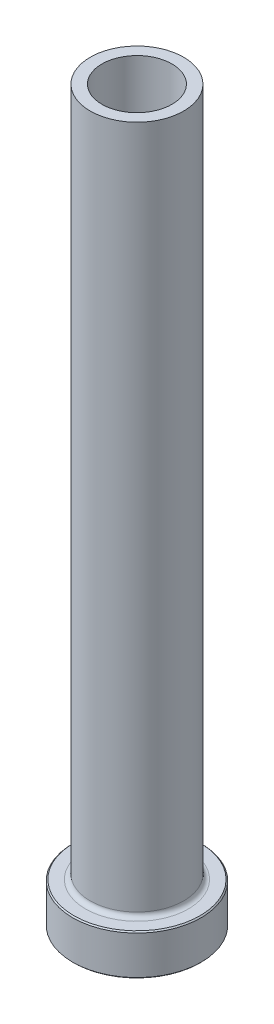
ISO-10303-21;
HEADER;
FILE_DESCRIPTION(('STEP AP214'),'2;1');
FILE_NAME('part.step','',(''),(''),'','','');
FILE_SCHEMA(('AUTOMOTIVE_DESIGN { 1 0 10303 214 1 1 1 1 }'));
ENDSEC;
DATA;
#1=APPLICATION_CONTEXT('core data for automotive mechanical design processes');
#2=APPLICATION_PROTOCOL_DEFINITION('international standard','automotive_design',2000,#1);
#3=PRODUCT_CONTEXT('',#1,'mechanical');
#4=PRODUCT('Part','Part','',(#3));
#5=PRODUCT_RELATED_PRODUCT_CATEGORY('part','',(#4));
#6=PRODUCT_DEFINITION_FORMATION('','',#4);
#7=PRODUCT_DEFINITION_CONTEXT('part definition',#1,'design');
#8=PRODUCT_DEFINITION('design','',#6,#7);
#9=PRODUCT_DEFINITION_SHAPE('','',#8);
#10=(LENGTH_UNIT() NAMED_UNIT(*) SI_UNIT(.MILLI.,.METRE.));
#11=(NAMED_UNIT(*) PLANE_ANGLE_UNIT() SI_UNIT($,.RADIAN.));
#12=(NAMED_UNIT(*) SI_UNIT($,.STERADIAN.) SOLID_ANGLE_UNIT());
#13=UNCERTAINTY_MEASURE_WITH_UNIT(LENGTH_MEASURE(1.E-05),#10,'distance_accuracy_value','');
#14=(GEOMETRIC_REPRESENTATION_CONTEXT(3) GLOBAL_UNCERTAINTY_ASSIGNED_CONTEXT((#13)) GLOBAL_UNIT_ASSIGNED_CONTEXT((#10,
#11,#12)) REPRESENTATION_CONTEXT('',''));
#15=CARTESIAN_POINT('',(0.,0.,0.));
#16=DIRECTION('',(0.,0.,1.));
#17=DIRECTION('',(1.,0.,0.));
#18=AXIS2_PLACEMENT_3D('',#15,#16,#17);
#19=CARTESIAN_POINT('',(0.,92.1876809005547,0.));
#20=DIRECTION('',(0.,1.,0.));
#21=DIRECTION('',(0.,0.,1.));
#22=AXIS2_PLACEMENT_3D('',#19,#20,#21);
#23=CYLINDRICAL_SURFACE('',#22,5.99999999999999);
#24=CARTESIAN_POINT('',(0.,125.,0.));
#25=DIRECTION('',(0.,1.,0.));
#26=DIRECTION('',(0.,0.,1.));
#27=AXIS2_PLACEMENT_3D('',#24,#25,#26);
#28=CIRCLE('',#27,5.99999999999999);
#29=CARTESIAN_POINT('',(0.,125.,5.99999999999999));
#30=VERTEX_POINT('',#29);
#31=EDGE_CURVE('E62',#30,#30,#28,.T.);
#32=ORIENTED_EDGE('',*,*,#31,.T.);
#33=EDGE_LOOP('',(#32));
#34=FACE_BOUND('',#33,.T.);
#35=CARTESIAN_POINT('',(0.,70.,0.));
#36=DIRECTION('',(0.,1.,0.));
#37=DIRECTION('',(0.,0.,1.));
#38=AXIS2_PLACEMENT_3D('',#35,#36,#37);
#39=CIRCLE('',#38,5.99999999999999);
#40=CARTESIAN_POINT('',(0.,70.,5.99999999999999));
#41=VERTEX_POINT('',#40);
#42=EDGE_CURVE('E71',#41,#41,#39,.T.);
#43=ORIENTED_EDGE('',*,*,#42,.F.);
#44=EDGE_LOOP('',(#43));
#45=FACE_BOUND('',#44,.T.);
#46=ADVANCED_FACE('F30',(#34,#45),#23,.F.);
#47=CARTESIAN_POINT('',(-5.99999999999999,125.,0.));
#48=DIRECTION('',(0.,1.,0.));
#49=DIRECTION('',(0.,0.,1.));
#50=AXIS2_PLACEMENT_3D('',#47,#48,#49);
#51=PLANE('',#50);
#52=CARTESIAN_POINT('',(0.,125.,0.));
#53=DIRECTION('',(0.,1.,0.));
#54=DIRECTION('',(0.,0.,1.));
#55=AXIS2_PLACEMENT_3D('',#52,#53,#54);
#56=CIRCLE('',#55,8.);
#57=CARTESIAN_POINT('',(0.,125.,8.));
#58=VERTEX_POINT('',#57);
#59=EDGE_CURVE('E65',#58,#58,#56,.T.);
#60=ORIENTED_EDGE('',*,*,#59,.T.);
#61=EDGE_LOOP('',(#60));
#62=FACE_BOUND('',#61,.T.);
#63=ORIENTED_EDGE('',*,*,#31,.F.);
#64=EDGE_LOOP('',(#63));
#65=FACE_BOUND('',#64,.T.);
#66=ADVANCED_FACE('F79',(#62,#65),#51,.T.);
#67=CARTESIAN_POINT('',(0.,92.1876809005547,0.));
#68=DIRECTION('',(0.,1.,0.));
#69=DIRECTION('',(0.,0.,1.));
#70=AXIS2_PLACEMENT_3D('',#67,#68,#69);
#71=CYLINDRICAL_SURFACE('',#70,8.);
#72=CARTESIAN_POINT('',(0.,7.8,0.));
#73=DIRECTION('',(0.,1.,0.));
#74=DIRECTION('',(0.,0.,1.));
#75=AXIS2_PLACEMENT_3D('',#72,#73,#74);
#76=CIRCLE('',#75,8.);
#77=CARTESIAN_POINT('',(0.,7.8,8.));
#78=VERTEX_POINT('',#77);
#79=EDGE_CURVE('E59',#78,#78,#76,.T.);
#80=ORIENTED_EDGE('',*,*,#79,.T.);
#81=EDGE_LOOP('',(#80));
#82=FACE_BOUND('',#81,.T.);
#83=ORIENTED_EDGE('',*,*,#59,.F.);
#84=EDGE_LOOP('',(#83));
#85=FACE_BOUND('',#84,.T.);
#86=ADVANCED_FACE('F85',(#82,#85),#71,.T.);
#87=CARTESIAN_POINT('',(-7.99999999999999,7.,0.));
#88=DIRECTION('',(0.,1.,0.));
#89=DIRECTION('',(0.,0.,1.));
#90=AXIS2_PLACEMENT_3D('',#87,#88,#89);
#91=PLANE('',#90);
#92=CARTESIAN_POINT('',(0.,7.,0.));
#93=DIRECTION('',(0.,1.,0.));
#94=DIRECTION('',(0.,0.,1.));
#95=AXIS2_PLACEMENT_3D('',#92,#93,#94);
#96=CIRCLE('',#95,10.8);
#97=CARTESIAN_POINT('',(0.,7.,10.8));
#98=VERTEX_POINT('',#97);
#99=EDGE_CURVE('E53',#98,#98,#96,.T.);
#100=ORIENTED_EDGE('',*,*,#99,.T.);
#101=EDGE_LOOP('',(#100));
#102=FACE_BOUND('',#101,.T.);
#103=CARTESIAN_POINT('',(0.,7.,0.));
#104=DIRECTION('',(0.,1.,0.));
#105=DIRECTION('',(0.,0.,1.));
#106=AXIS2_PLACEMENT_3D('',#103,#104,#105);
#107=CIRCLE('',#106,8.8);
#108=CARTESIAN_POINT('',(0.,7.,8.8));
#109=VERTEX_POINT('',#108);
#110=EDGE_CURVE('E56',#109,#109,#107,.F.);
#111=ORIENTED_EDGE('',*,*,#110,.T.);
#112=EDGE_LOOP('',(#111));
#113=FACE_BOUND('',#112,.T.);
#114=ADVANCED_FACE('F111',(#102,#113),#91,.T.);
#115=CARTESIAN_POINT('',(0.,92.1876809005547,0.));
#116=DIRECTION('',(0.,1.,0.));
#117=DIRECTION('',(0.,0.,1.));
#118=AXIS2_PLACEMENT_3D('',#115,#116,#117);
#119=CYLINDRICAL_SURFACE('',#118,11.);
#120=CARTESIAN_POINT('',(0.,6.80000000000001,0.));
#121=DIRECTION('',(0.,1.,0.));
#122=DIRECTION('',(0.,0.,1.));
#123=AXIS2_PLACEMENT_3D('',#120,#121,#122);
#124=CIRCLE('',#123,11.);
#125=CARTESIAN_POINT('',(0.,6.80000000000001,11.));
#126=VERTEX_POINT('',#125);
#127=EDGE_CURVE('E45',#126,#126,#124,.F.);
#128=ORIENTED_EDGE('',*,*,#127,.T.);
#129=EDGE_LOOP('',(#128));
#130=FACE_BOUND('',#129,.T.);
#131=CARTESIAN_POINT('',(0.,0.20000000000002,0.));
#132=DIRECTION('',(0.,-1.,0.));
#133=DIRECTION('',(0.,0.,-1.));
#134=AXIS2_PLACEMENT_3D('',#131,#132,#133);
#135=CIRCLE('',#134,11.);
#136=CARTESIAN_POINT('',(0.,0.20000000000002,-11.));
#137=VERTEX_POINT('',#136);
#138=EDGE_CURVE('E50',#137,#137,#135,.F.);
#139=ORIENTED_EDGE('',*,*,#138,.T.);
#140=EDGE_LOOP('',(#139));
#141=FACE_BOUND('',#140,.T.);
#142=ADVANCED_FACE('F108',(#130,#141),#119,.T.);
#143=CARTESIAN_POINT('',(-11.,0.,0.));
#144=DIRECTION('',(0.,-1.,0.));
#145=DIRECTION('',(0.,0.,-1.));
#146=AXIS2_PLACEMENT_3D('',#143,#144,#145);
#147=PLANE('',#146);
#148=CARTESIAN_POINT('',(0.,0.,0.));
#149=DIRECTION('',(0.,-1.,0.));
#150=DIRECTION('',(0.,0.,-1.));
#151=AXIS2_PLACEMENT_3D('',#148,#149,#150);
#152=CIRCLE('',#151,6.74999999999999);
#153=CARTESIAN_POINT('',(0.,0.,-6.74999999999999));
#154=VERTEX_POINT('',#153);
#155=EDGE_CURVE('E37',#154,#154,#152,.F.);
#156=ORIENTED_EDGE('',*,*,#155,.T.);
#157=EDGE_LOOP('',(#156));
#158=FACE_BOUND('',#157,.T.);
#159=CARTESIAN_POINT('',(0.,0.,0.));
#160=DIRECTION('',(0.,-1.,0.));
#161=DIRECTION('',(0.,0.,-1.));
#162=AXIS2_PLACEMENT_3D('',#159,#160,#161);
#163=CIRCLE('',#162,10.8);
#164=CARTESIAN_POINT('',(0.,0.,-10.8));
#165=VERTEX_POINT('',#164);
#166=EDGE_CURVE('E41',#165,#165,#163,.T.);
#167=ORIENTED_EDGE('',*,*,#166,.T.);
#168=EDGE_LOOP('',(#167));
#169=FACE_BOUND('',#168,.T.);
#170=ADVANCED_FACE('F110',(#158,#169),#147,.T.);
#171=CARTESIAN_POINT('',(0.,92.1876809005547,0.));
#172=DIRECTION('',(0.,1.,0.));
#173=DIRECTION('',(0.,0.,1.));
#174=AXIS2_PLACEMENT_3D('',#171,#172,#173);
#175=CYLINDRICAL_SURFACE('',#174,6.24999999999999);
#176=CARTESIAN_POINT('',(0.,0.5,0.));
#177=DIRECTION('',(0.,-1.,0.));
#178=DIRECTION('',(0.,0.,-1.));
#179=AXIS2_PLACEMENT_3D('',#176,#177,#178);
#180=CIRCLE('',#179,6.24999999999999);
#181=CARTESIAN_POINT('',(0.,0.5,-6.24999999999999));
#182=VERTEX_POINT('',#181);
#183=EDGE_CURVE('E10',#182,#182,#180,.T.);
#184=ORIENTED_EDGE('',*,*,#183,.T.);
#185=EDGE_LOOP('',(#184));
#186=FACE_BOUND('',#185,.T.);
#187=CARTESIAN_POINT('',(0.,58.,0.));
#188=DIRECTION('',(0.,1.,0.));
#189=DIRECTION('',(0.,0.,1.));
#190=AXIS2_PLACEMENT_3D('',#187,#188,#189);
#191=CIRCLE('',#190,6.25);
#192=CARTESIAN_POINT('',(0.,58.,6.25));
#193=VERTEX_POINT('',#192);
#194=EDGE_CURVE('E68',#193,#193,#191,.T.);
#195=ORIENTED_EDGE('',*,*,#194,.T.);
#196=EDGE_LOOP('',(#195));
#197=FACE_BOUND('',#196,.T.);
#198=ADVANCED_FACE('F118',(#186,#197),#175,.F.);
#199=CARTESIAN_POINT('',(0.,58.,0.));
#200=DIRECTION('',(0.,-1.,0.));
#201=DIRECTION('',(0.,0.,-1.));
#202=AXIS2_PLACEMENT_3D('',#199,#200,#201);
#203=CONICAL_SURFACE('',#202,6.25,0.0208303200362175);
#204=ORIENTED_EDGE('',*,*,#42,.T.);
#205=EDGE_LOOP('',(#204));
#206=FACE_BOUND('',#205,.T.);
#207=ORIENTED_EDGE('',*,*,#194,.F.);
#208=EDGE_LOOP('',(#207));
#209=FACE_BOUND('',#208,.T.);
#210=ADVANCED_FACE('F75',(#206,#209),#203,.F.);
#211=CARTESIAN_POINT('',(0.,7.8,0.));
#212=DIRECTION('',(0.,1.,0.));
#213=DIRECTION('',(0.,0.,1.));
#214=AXIS2_PLACEMENT_3D('',#211,#212,#213);
#215=TOROIDAL_SURFACE('',#214,8.8,0.8);
#216=ORIENTED_EDGE('',*,*,#110,.F.);
#217=EDGE_LOOP('',(#216));
#218=FACE_BOUND('',#217,.T.);
#219=ORIENTED_EDGE('',*,*,#79,.F.);
#220=EDGE_LOOP('',(#219));
#221=FACE_BOUND('',#220,.T.);
#222=ADVANCED_FACE('F90',(#218,#221),#215,.F.);
#223=CARTESIAN_POINT('',(0.,7.00000000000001,0.));
#224=DIRECTION('',(0.,-1.,0.));
#225=DIRECTION('',(0.,0.,-1.));
#226=AXIS2_PLACEMENT_3D('',#223,#224,#225);
#227=CONICAL_SURFACE('',#226,10.8,0.785398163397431);
#228=ORIENTED_EDGE('',*,*,#127,.F.);
#229=EDGE_LOOP('',(#228));
#230=FACE_BOUND('',#229,.T.);
#231=ORIENTED_EDGE('',*,*,#99,.F.);
#232=EDGE_LOOP('',(#231));
#233=FACE_BOUND('',#232,.T.);
#234=ADVANCED_FACE('F93',(#230,#233),#227,.T.);
#235=CARTESIAN_POINT('',(0.,0.20000000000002,0.));
#236=DIRECTION('',(0.,1.,0.));
#237=DIRECTION('',(0.,0.,1.));
#238=AXIS2_PLACEMENT_3D('',#235,#236,#237);
#239=CONICAL_SURFACE('',#238,11.,0.785398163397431);
#240=ORIENTED_EDGE('',*,*,#166,.F.);
#241=EDGE_LOOP('',(#240));
#242=FACE_BOUND('',#241,.T.);
#243=ORIENTED_EDGE('',*,*,#138,.F.);
#244=EDGE_LOOP('',(#243));
#245=FACE_BOUND('',#244,.T.);
#246=ADVANCED_FACE('F96',(#242,#245),#239,.T.);
#247=CARTESIAN_POINT('',(0.,0.,0.));
#248=DIRECTION('',(0.,-1.,0.));
#249=DIRECTION('',(0.,0.,-1.));
#250=AXIS2_PLACEMENT_3D('',#247,#248,#249);
#251=CONICAL_SURFACE('',#250,6.74999999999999,0.785398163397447);
#252=ORIENTED_EDGE('',*,*,#183,.F.);
#253=EDGE_LOOP('',(#252));
#254=FACE_BOUND('',#253,.T.);
#255=ORIENTED_EDGE('',*,*,#155,.F.);
#256=EDGE_LOOP('',(#255));
#257=FACE_BOUND('',#256,.T.);
#258=ADVANCED_FACE('F32',(#254,#257),#251,.F.);
#259=CLOSED_SHELL('',(#46,#66,#86,#114,#142,#170,#198,#210,#222,#234,#246,#258));
#260=MANIFOLD_SOLID_BREP('B2',#259);
#261=ADVANCED_BREP_SHAPE_REPRESENTATION('',(#18,#260),#14);
#262=SHAPE_DEFINITION_REPRESENTATION(#9,#261);
ENDSEC;
END-ISO-10303-21;
